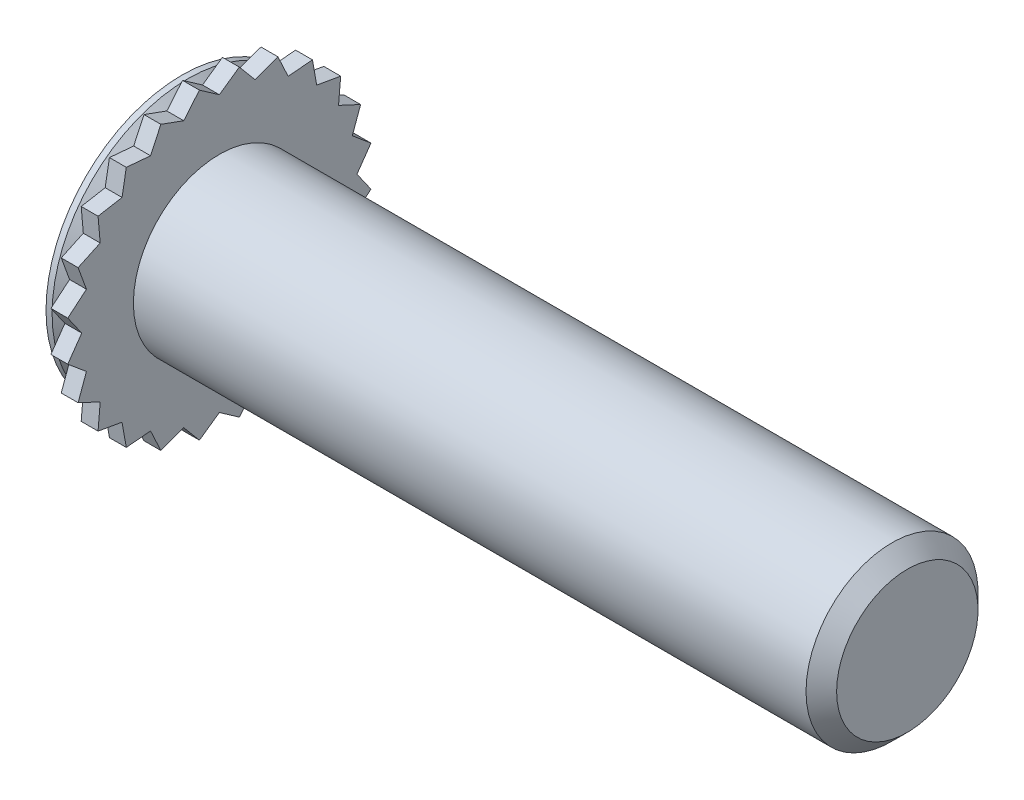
from build123d import *

# Parameters (mm, degrees)
CLINCHCUT_DEPTH    = 0.4905
CLINCHCUTPAT_COUNT = 24
CLINCHCUTPAT_ANGLE = 345


with BuildPart() as part:
    # BodySke → BaseBody (revolve)
    with BuildSketch(Plane.XY, mode=Mode.PRIVATE) as basebody_sk:
        Polygon((0, 2.2225), (0, 3.95), (0.1778, 3.95), (0.4905, 3.6373), (0.5995, 3.6373), (0.5995, 4.445), (1.09, 4.445), (1.09, 2.5), (20.645, 2.5), (21.09, 2.055), (21.09, 0), (0.545, 0), (0.545, 1.6775), align=None)
    revolve(basebody_sk.sketch.rotate(Axis((0, 0, 0), (1, 0, 0)), 90), axis=Axis((0, 0, 0), (1, 0, 0)))

    # CliRinCutSke → ClinchCut (cut)
    with BuildSketch(Plane(origin=(1.09, 0, 0), x_dir=(0, 0, -1), z_dir=(1, 0, 0))):
        with BuildLine():
            Line((0.580188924, 4.406972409), (0, 4.0005))
            Line((0, 4.0005), (-0.580188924, 4.406972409))
            ThreePointArc((-0.580188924, 4.406972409), (0, 4.445), (0.580188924, 4.406972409))
        make_face()
    clinchcut = extrude(amount=-CLINCHCUT_DEPTH, mode=Mode.SUBTRACT)

    # ClinchCutPat: ClinchCut ×24 about axis
    clinchcutpat_axis = Axis((0, 0, 0), (1, 0, 0))
    for i in range(1, CLINCHCUTPAT_COUNT):
        add(clinchcut.rotate(clinchcutpat_axis, i * CLINCHCUTPAT_ANGLE / (CLINCHCUTPAT_COUNT - 1)), mode=Mode.SUBTRACT)


solid = part.part
